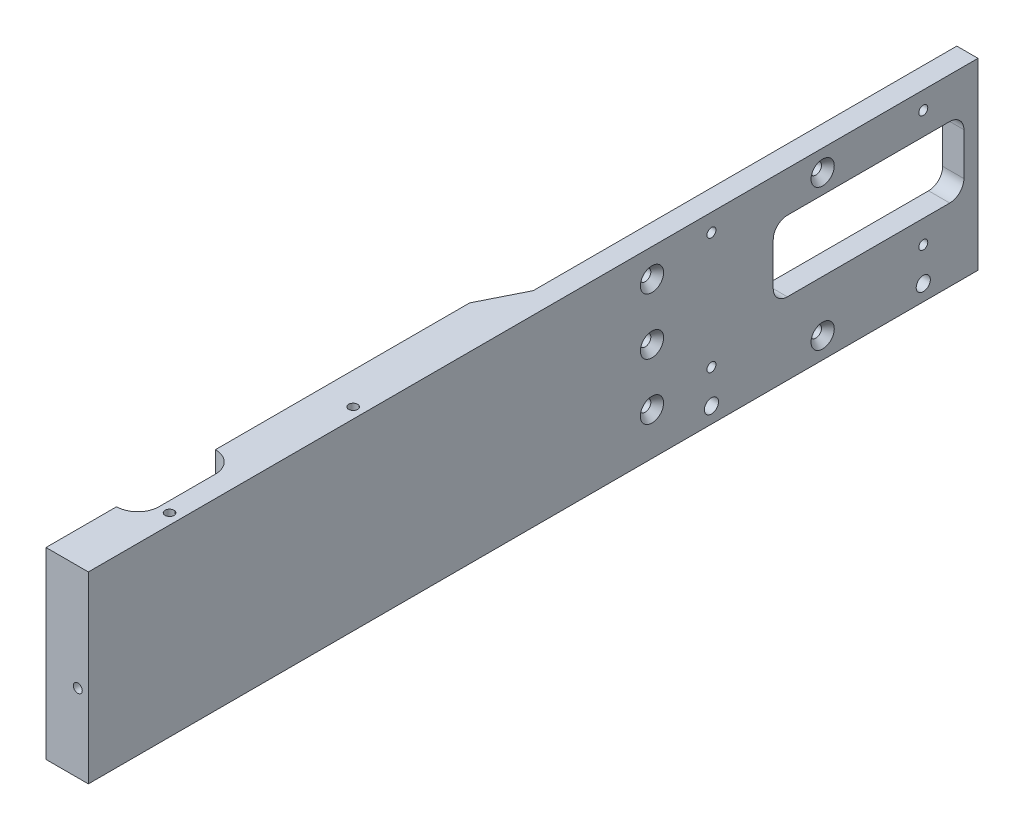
ISO-10303-21;
HEADER;
FILE_DESCRIPTION(('STEP AP214'),'2;1');
FILE_NAME('part.step','',(''),(''),'','','');
FILE_SCHEMA(('AUTOMOTIVE_DESIGN { 1 0 10303 214 1 1 1 1 }'));
ENDSEC;
DATA;
#1=APPLICATION_CONTEXT('core data for automotive mechanical design processes');
#2=APPLICATION_PROTOCOL_DEFINITION('international standard','automotive_design',2000,#1);
#3=PRODUCT_CONTEXT('',#1,'mechanical');
#4=PRODUCT('Part','Part','',(#3));
#5=PRODUCT_RELATED_PRODUCT_CATEGORY('part','',(#4));
#6=PRODUCT_DEFINITION_FORMATION('','',#4);
#7=PRODUCT_DEFINITION_CONTEXT('part definition',#1,'design');
#8=PRODUCT_DEFINITION('design','',#6,#7);
#9=PRODUCT_DEFINITION_SHAPE('','',#8);
#10=(LENGTH_UNIT() NAMED_UNIT(*) SI_UNIT(.MILLI.,.METRE.));
#11=(NAMED_UNIT(*) PLANE_ANGLE_UNIT() SI_UNIT($,.RADIAN.));
#12=(NAMED_UNIT(*) SI_UNIT($,.STERADIAN.) SOLID_ANGLE_UNIT());
#13=UNCERTAINTY_MEASURE_WITH_UNIT(LENGTH_MEASURE(1.E-05),#10,'distance_accuracy_value','');
#14=(GEOMETRIC_REPRESENTATION_CONTEXT(3) GLOBAL_UNCERTAINTY_ASSIGNED_CONTEXT((#13)) GLOBAL_UNIT_ASSIGNED_CONTEXT((#10,
#11,#12)) REPRESENTATION_CONTEXT('',''));
#15=CARTESIAN_POINT('',(0.,0.,0.));
#16=DIRECTION('',(0.,0.,1.));
#17=DIRECTION('',(1.,0.,0.));
#18=AXIS2_PLACEMENT_3D('',#15,#16,#17);
#19=CARTESIAN_POINT('',(82.423,34.1376,-190.5));
#20=DIRECTION('',(0.,1.,0.));
#21=DIRECTION('',(0.,0.,1.));
#22=AXIS2_PLACEMENT_3D('',#19,#20,#21);
#23=PLANE('',#22);
#24=CARTESIAN_POINT('',(87.1855,34.1376,-123.824999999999));
#25=DIRECTION('',(0.,1.,0.));
#26=DIRECTION('',(0.,0.,1.));
#27=AXIS2_PLACEMENT_3D('',#24,#25,#26);
#28=CIRCLE('',#27,2.0193);
#29=CARTESIAN_POINT('',(87.1855,34.1376,-121.805699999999));
#30=VERTEX_POINT('',#29);
#31=EDGE_CURVE('E232',#30,#30,#28,.T.);
#32=ORIENTED_EDGE('',*,*,#31,.F.);
#33=EDGE_LOOP('',(#32));
#34=FACE_BOUND('',#33,.T.);
#35=CARTESIAN_POINT('',(87.1855,34.1376,-41.2749999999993));
#36=DIRECTION('',(0.,1.,0.));
#37=DIRECTION('',(0.,0.,1.));
#38=AXIS2_PLACEMENT_3D('',#35,#36,#37);
#39=CIRCLE('',#38,2.0193);
#40=CARTESIAN_POINT('',(87.1855,34.1376,-39.2556999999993));
#41=VERTEX_POINT('',#40);
#42=EDGE_CURVE('E226',#41,#41,#39,.T.);
#43=ORIENTED_EDGE('',*,*,#42,.F.);
#44=EDGE_LOOP('',(#43));
#45=FACE_BOUND('',#44,.T.);
#46=DIRECTION('',(0.,0.,-1.));
#47=VECTOR('',#46,1.);
#48=CARTESIAN_POINT('',(72.898,34.1376,0.));
#49=LINE('',#48,#47);
#50=CARTESIAN_POINT('',(72.898,34.1376,-76.2));
#51=VERTEX_POINT('',#50);
#52=CARTESIAN_POINT('',(72.898,34.1376,-190.5));
#53=VERTEX_POINT('',#52);
#54=EDGE_CURVE('E205',#51,#53,#49,.T.);
#55=ORIENTED_EDGE('',*,*,#54,.F.);
#56=CARTESIAN_POINT('',(72.898,34.1376,-66.675));
#57=DIRECTION('',(0.,-1.,0.));
#58=DIRECTION('',(0.,0.,-1.));
#59=AXIS2_PLACEMENT_3D('',#56,#57,#58);
#60=CIRCLE('',#59,9.52500000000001);
#61=CARTESIAN_POINT('',(82.423,34.1376,-66.675));
#62=VERTEX_POINT('',#61);
#63=EDGE_CURVE('E187',#51,#62,#60,.T.);
#64=ORIENTED_EDGE('',*,*,#63,.T.);
#65=DIRECTION('',(0.,0.,1.));
#66=VECTOR('',#65,1.);
#67=CARTESIAN_POINT('',(82.423,34.1376,-66.675));
#68=LINE('',#67,#66);
#69=CARTESIAN_POINT('',(82.423,34.1376,-41.275));
#70=VERTEX_POINT('',#69);
#71=EDGE_CURVE('E196',#62,#70,#68,.T.);
#72=ORIENTED_EDGE('',*,*,#71,.T.);
#73=CARTESIAN_POINT('',(72.898,34.1376,-41.275));
#74=DIRECTION('',(0.,-1.,0.));
#75=DIRECTION('',(0.,0.,-1.));
#76=AXIS2_PLACEMENT_3D('',#73,#74,#75);
#77=CIRCLE('',#76,9.52500000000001);
#78=CARTESIAN_POINT('',(72.898,34.1376,-31.75));
#79=VERTEX_POINT('',#78);
#80=EDGE_CURVE('E201',#70,#79,#77,.T.);
#81=ORIENTED_EDGE('',*,*,#80,.T.);
#82=CARTESIAN_POINT('',(72.898,34.1376,0.));
#83=VERTEX_POINT('',#82);
#84=EDGE_CURVE('E285',#83,#79,#49,.T.);
#85=ORIENTED_EDGE('',*,*,#84,.F.);
#86=DIRECTION('',(-1.,0.,0.));
#87=VECTOR('',#86,1.);
#88=CARTESIAN_POINT('',(72.898,34.1376,0.));
#89=LINE('',#88,#87);
#90=CARTESIAN_POINT('',(91.948,34.1376,0.));
#91=VERTEX_POINT('',#90);
#92=EDGE_CURVE('E283',#91,#83,#89,.T.);
#93=ORIENTED_EDGE('',*,*,#92,.F.);
#94=DIRECTION('',(0.,0.,1.));
#95=VECTOR('',#94,1.);
#96=CARTESIAN_POINT('',(91.948,34.1376,-190.5));
#97=LINE('',#96,#95);
#98=CARTESIAN_POINT('',(91.948,34.1376,-400.05));
#99=VERTEX_POINT('',#98);
#100=EDGE_CURVE('E412',#99,#91,#97,.T.);
#101=ORIENTED_EDGE('',*,*,#100,.F.);
#102=DIRECTION('',(1.,0.,0.));
#103=VECTOR('',#102,1.);
#104=CARTESIAN_POINT('',(82.423,34.1376,-400.05));
#105=LINE('',#104,#103);
#106=CARTESIAN_POINT('',(82.423,34.1376,-400.05));
#107=VERTEX_POINT('',#106);
#108=EDGE_CURVE('E320',#107,#99,#105,.T.);
#109=ORIENTED_EDGE('',*,*,#108,.F.);
#110=DIRECTION('',(0.,0.,1.));
#111=VECTOR('',#110,1.);
#112=CARTESIAN_POINT('',(82.423,34.1376,-190.5));
#113=LINE('',#112,#111);
#114=CARTESIAN_POINT('',(82.423,34.1376,-209.55));
#115=VERTEX_POINT('',#114);
#116=EDGE_CURVE('E429',#107,#115,#113,.T.);
#117=ORIENTED_EDGE('',*,*,#116,.T.);
#118=DIRECTION('',(-0.447213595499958,0.,0.894427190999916));
#119=VECTOR('',#118,1.);
#120=CARTESIAN_POINT('',(72.898,34.1376,-190.5));
#121=LINE('',#120,#119);
#122=EDGE_CURVE('E300',#115,#53,#121,.T.);
#123=ORIENTED_EDGE('',*,*,#122,.T.);
#124=EDGE_LOOP('',(#55,#64,#72,#81,#85,#93,#101,#109,#117,#123));
#125=FACE_BOUND('',#124,.T.);
#126=ADVANCED_FACE('F44',(#34,#45,#125),#23,.T.);
#127=CARTESIAN_POINT('',(82.423,-48.4187500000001,-190.5));
#128=DIRECTION('',(0.,-1.,0.));
#129=DIRECTION('',(0.,0.,-1.));
#130=AXIS2_PLACEMENT_3D('',#127,#128,#129);
#131=PLANE('',#130);
#132=DIRECTION('',(0.,0.,-1.));
#133=VECTOR('',#132,1.);
#134=CARTESIAN_POINT('',(82.423,-48.4187500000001,-190.5));
#135=LINE('',#134,#133);
#136=CARTESIAN_POINT('',(82.423,-48.41875,-41.275));
#137=VERTEX_POINT('',#136);
#138=CARTESIAN_POINT('',(82.423,-48.41875,-66.675));
#139=VERTEX_POINT('',#138);
#140=EDGE_CURVE('E11',#137,#139,#135,.T.);
#141=ORIENTED_EDGE('',*,*,#140,.T.);
#142=CARTESIAN_POINT('',(72.898,-48.41875,-66.675));
#143=DIRECTION('',(0.,-1.,0.));
#144=DIRECTION('',(0.,0.,-1.));
#145=AXIS2_PLACEMENT_3D('',#142,#143,#144);
#146=CIRCLE('',#145,9.52500000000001);
#147=CARTESIAN_POINT('',(72.898,-48.4187500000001,-76.2));
#148=VERTEX_POINT('',#147);
#149=EDGE_CURVE('E190',#139,#148,#146,.F.);
#150=ORIENTED_EDGE('',*,*,#149,.T.);
#151=DIRECTION('',(0.,0.,-1.));
#152=VECTOR('',#151,1.);
#153=CARTESIAN_POINT('',(72.898,-48.4187500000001,0.));
#154=LINE('',#153,#152);
#155=CARTESIAN_POINT('',(72.898,-48.4187500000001,-190.5));
#156=VERTEX_POINT('',#155);
#157=EDGE_CURVE('E288',#148,#156,#154,.T.);
#158=ORIENTED_EDGE('',*,*,#157,.T.);
#159=DIRECTION('',(-0.447213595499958,0.,0.894427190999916));
#160=VECTOR('',#159,1.);
#161=CARTESIAN_POINT('',(72.898,-48.4187500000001,-190.5));
#162=LINE('',#161,#160);
#163=CARTESIAN_POINT('',(82.423,-48.4187500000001,-209.55));
#164=VERTEX_POINT('',#163);
#165=EDGE_CURVE('E292',#164,#156,#162,.T.);
#166=ORIENTED_EDGE('',*,*,#165,.F.);
#167=DIRECTION('',(0.,0.,-1.));
#168=VECTOR('',#167,1.);
#169=CARTESIAN_POINT('',(82.423,-48.4187500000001,-190.5));
#170=LINE('',#169,#168);
#171=CARTESIAN_POINT('',(82.423,-48.4187500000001,-400.05));
#172=VERTEX_POINT('',#171);
#173=EDGE_CURVE('E301',#164,#172,#170,.T.);
#174=ORIENTED_EDGE('',*,*,#173,.T.);
#175=DIRECTION('',(1.,0.,0.));
#176=VECTOR('',#175,1.);
#177=CARTESIAN_POINT('',(82.423,-48.4187500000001,-400.05));
#178=LINE('',#177,#176);
#179=CARTESIAN_POINT('',(91.948,-48.4187500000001,-400.05));
#180=VERTEX_POINT('',#179);
#181=EDGE_CURVE('E408',#172,#180,#178,.T.);
#182=ORIENTED_EDGE('',*,*,#181,.T.);
#183=DIRECTION('',(0.,0.,-1.));
#184=VECTOR('',#183,1.);
#185=CARTESIAN_POINT('',(91.948,-48.4187500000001,-190.5));
#186=LINE('',#185,#184);
#187=CARTESIAN_POINT('',(91.948,-48.4187500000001,0.));
#188=VERTEX_POINT('',#187);
#189=EDGE_CURVE('E413',#188,#180,#186,.T.);
#190=ORIENTED_EDGE('',*,*,#189,.F.);
#191=DIRECTION('',(1.,0.,0.));
#192=VECTOR('',#191,1.);
#193=CARTESIAN_POINT('',(72.898,-48.4187500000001,0.));
#194=LINE('',#193,#192);
#195=CARTESIAN_POINT('',(72.898,-48.4187500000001,0.));
#196=VERTEX_POINT('',#195);
#197=EDGE_CURVE('E276',#196,#188,#194,.T.);
#198=ORIENTED_EDGE('',*,*,#197,.F.);
#199=CARTESIAN_POINT('',(72.898,-48.4187500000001,-31.75));
#200=VERTEX_POINT('',#199);
#201=EDGE_CURVE('E289',#196,#200,#154,.T.);
#202=ORIENTED_EDGE('',*,*,#201,.T.);
#203=CARTESIAN_POINT('',(72.898,-48.41875,-41.275));
#204=DIRECTION('',(0.,-1.,0.));
#205=DIRECTION('',(0.,0.,-1.));
#206=AXIS2_PLACEMENT_3D('',#203,#204,#205);
#207=CIRCLE('',#206,9.52500000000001);
#208=EDGE_CURVE('E61',#200,#137,#207,.F.);
#209=ORIENTED_EDGE('',*,*,#208,.T.);
#210=EDGE_LOOP('',(#141,#150,#158,#166,#174,#182,#190,#198,#202,#209));
#211=FACE_BOUND('',#210,.T.);
#212=ADVANCED_FACE('F46',(#211),#131,.T.);
#213=CARTESIAN_POINT('',(72.898,34.1376,0.));
#214=DIRECTION('',(1.,0.,0.));
#215=DIRECTION('',(0.,0.,-1.));
#216=AXIS2_PLACEMENT_3D('',#213,#214,#215);
#217=PLANE('',#216);
#218=DIRECTION('',(0.,1.,0.));
#219=VECTOR('',#218,1.);
#220=CARTESIAN_POINT('',(72.898,-48.4188000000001,-76.2));
#221=LINE('',#220,#219);
#222=EDGE_CURVE('E53',#51,#148,#221,.F.);
#223=ORIENTED_EDGE('',*,*,#222,.F.);
#224=ORIENTED_EDGE('',*,*,#54,.T.);
#225=DIRECTION('',(0.,-1.,0.));
#226=VECTOR('',#225,1.);
#227=CARTESIAN_POINT('',(72.898,55.4361474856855,-190.5));
#228=LINE('',#227,#226);
#229=EDGE_CURVE('E295',#53,#156,#228,.T.);
#230=ORIENTED_EDGE('',*,*,#229,.T.);
#231=ORIENTED_EDGE('',*,*,#157,.F.);
#232=EDGE_LOOP('',(#223,#224,#230,#231));
#233=FACE_BOUND('',#232,.T.);
#234=ADVANCED_FACE('F382',(#233),#217,.F.);
#235=DIRECTION('',(0.,1.,0.));
#236=VECTOR('',#235,1.);
#237=CARTESIAN_POINT('',(72.898,-48.4188000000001,-31.75));
#238=LINE('',#237,#236);
#239=EDGE_CURVE('E317',#200,#79,#238,.T.);
#240=ORIENTED_EDGE('',*,*,#239,.F.);
#241=ORIENTED_EDGE('',*,*,#201,.F.);
#242=DIRECTION('',(0.,-1.,0.));
#243=VECTOR('',#242,1.);
#244=CARTESIAN_POINT('',(72.898,34.1376,0.));
#245=LINE('',#244,#243);
#246=EDGE_CURVE('E270',#83,#196,#245,.T.);
#247=ORIENTED_EDGE('',*,*,#246,.F.);
#248=ORIENTED_EDGE('',*,*,#84,.T.);
#249=EDGE_LOOP('',(#240,#241,#247,#248));
#250=FACE_BOUND('',#249,.T.);
#251=ADVANCED_FACE('F538',(#250),#217,.F.);
#252=CARTESIAN_POINT('',(82.423,-48.4187500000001,-190.5));
#253=DIRECTION('',(1.,0.,0.));
#254=DIRECTION('',(0.,0.,-1.));
#255=AXIS2_PLACEMENT_3D('',#252,#253,#254);
#256=PLANE('',#255);
#257=CARTESIAN_POINT('',(82.423,21.4376,-253.4412));
#258=DIRECTION('',(1.,0.,0.));
#259=DIRECTION('',(0.,0.,-1.));
#260=AXIS2_PLACEMENT_3D('',#257,#258,#259);
#261=CIRCLE('',#260,2.5527);
#262=CARTESIAN_POINT('',(82.423,21.4376,-255.9939));
#263=VERTEX_POINT('',#262);
#264=EDGE_CURVE('E48',#263,#263,#261,.T.);
#265=ORIENTED_EDGE('',*,*,#264,.T.);
#266=EDGE_LOOP('',(#265));
#267=FACE_BOUND('',#266,.T.);
#268=CARTESIAN_POINT('',(82.423,-3.9624,-253.4412));
#269=DIRECTION('',(1.,0.,0.));
#270=DIRECTION('',(0.,0.,-1.));
#271=AXIS2_PLACEMENT_3D('',#268,#269,#270);
#272=CIRCLE('',#271,2.5527);
#273=CARTESIAN_POINT('',(82.423,-3.9624,-255.9939));
#274=VERTEX_POINT('',#273);
#275=EDGE_CURVE('E332',#274,#274,#272,.T.);
#276=ORIENTED_EDGE('',*,*,#275,.T.);
#277=EDGE_LOOP('',(#276));
#278=FACE_BOUND('',#277,.T.);
#279=CARTESIAN_POINT('',(82.423,-38.8937500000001,-330.2));
#280=DIRECTION('',(1.,0.,0.));
#281=DIRECTION('',(0.,0.,-1.));
#282=AXIS2_PLACEMENT_3D('',#279,#280,#281);
#283=CIRCLE('',#282,2.5527);
#284=CARTESIAN_POINT('',(82.423,-38.8937500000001,-332.7527));
#285=VERTEX_POINT('',#284);
#286=EDGE_CURVE('E328',#285,#285,#283,.T.);
#287=ORIENTED_EDGE('',*,*,#286,.T.);
#288=EDGE_LOOP('',(#287));
#289=FACE_BOUND('',#288,.T.);
#290=CARTESIAN_POINT('',(82.423,24.6126,-330.2));
#291=DIRECTION('',(1.,0.,0.));
#292=DIRECTION('',(0.,0.,-1.));
#293=AXIS2_PLACEMENT_3D('',#290,#291,#292);
#294=CIRCLE('',#293,2.5527);
#295=CARTESIAN_POINT('',(82.423,24.6126,-332.7527));
#296=VERTEX_POINT('',#295);
#297=EDGE_CURVE('E323',#296,#296,#294,.T.);
#298=ORIENTED_EDGE('',*,*,#297,.T.);
#299=EDGE_LOOP('',(#298));
#300=FACE_BOUND('',#299,.T.);
#301=CARTESIAN_POINT('',(82.423,-29.3624,-253.4412));
#302=DIRECTION('',(1.,0.,0.));
#303=DIRECTION('',(0.,0.,-1.));
#304=AXIS2_PLACEMENT_3D('',#301,#302,#303);
#305=CIRCLE('',#304,2.5527);
#306=CARTESIAN_POINT('',(82.423,-29.3624,-255.9939));
#307=VERTEX_POINT('',#306);
#308=EDGE_CURVE('E206',#307,#307,#305,.T.);
#309=ORIENTED_EDGE('',*,*,#308,.T.);
#310=EDGE_LOOP('',(#309));
#311=FACE_BOUND('',#310,.T.);
#312=CARTESIAN_POINT('',(82.423,-41.275,-280.19375));
#313=DIRECTION('',(1.,0.,0.));
#314=DIRECTION('',(0.,0.,-1.));
#315=AXIS2_PLACEMENT_3D('',#312,#313,#314);
#316=CIRCLE('',#315,3.17499999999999);
#317=CARTESIAN_POINT('',(82.423,-41.275,-283.36875));
#318=VERTEX_POINT('',#317);
#319=EDGE_CURVE('E242',#318,#318,#316,.T.);
#320=ORIENTED_EDGE('',*,*,#319,.T.);
#321=EDGE_LOOP('',(#320));
#322=FACE_BOUND('',#321,.T.);
#323=CARTESIAN_POINT('',(82.423,-41.275,-375.44375));
#324=DIRECTION('',(1.,0.,0.));
#325=DIRECTION('',(0.,0.,-1.));
#326=AXIS2_PLACEMENT_3D('',#323,#324,#325);
#327=CIRCLE('',#326,3.17499999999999);
#328=CARTESIAN_POINT('',(82.423,-41.275,-378.61875));
#329=VERTEX_POINT('',#328);
#330=EDGE_CURVE('E246',#329,#329,#327,.T.);
#331=ORIENTED_EDGE('',*,*,#330,.T.);
#332=EDGE_LOOP('',(#331));
#333=FACE_BOUND('',#332,.T.);
#334=CARTESIAN_POINT('',(82.423,-26.1874,-280.19375));
#335=DIRECTION('',(-1.,0.,0.));
#336=DIRECTION('',(0.,0.,1.));
#337=AXIS2_PLACEMENT_3D('',#334,#335,#336);
#338=CIRCLE('',#337,2.01929999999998);
#339=CARTESIAN_POINT('',(82.423,-26.1874,-278.17445));
#340=VERTEX_POINT('',#339);
#341=EDGE_CURVE('E251',#340,#340,#338,.T.);
#342=ORIENTED_EDGE('',*,*,#341,.F.);
#343=EDGE_LOOP('',(#342));
#344=FACE_BOUND('',#343,.T.);
#345=CARTESIAN_POINT('',(82.423,26.2001,-280.19375));
#346=DIRECTION('',(-1.,0.,0.));
#347=DIRECTION('',(0.,0.,1.));
#348=AXIS2_PLACEMENT_3D('',#345,#346,#347);
#349=CIRCLE('',#348,2.01929999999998);
#350=CARTESIAN_POINT('',(82.423,26.2001,-278.17445));
#351=VERTEX_POINT('',#350);
#352=EDGE_CURVE('E250',#351,#351,#349,.T.);
#353=ORIENTED_EDGE('',*,*,#352,.F.);
#354=EDGE_LOOP('',(#353));
#355=FACE_BOUND('',#354,.T.);
#356=CARTESIAN_POINT('',(82.423,-26.1874,-375.44375));
#357=DIRECTION('',(-1.,0.,0.));
#358=DIRECTION('',(0.,0.,1.));
#359=AXIS2_PLACEMENT_3D('',#356,#357,#358);
#360=CIRCLE('',#359,2.01929999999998);
#361=CARTESIAN_POINT('',(82.423,-26.1874,-373.42445));
#362=VERTEX_POINT('',#361);
#363=EDGE_CURVE('E257',#362,#362,#360,.T.);
#364=ORIENTED_EDGE('',*,*,#363,.F.);
#365=EDGE_LOOP('',(#364));
#366=FACE_BOUND('',#365,.T.);
#367=CARTESIAN_POINT('',(82.423,26.2001,-375.44375));
#368=DIRECTION('',(-1.,0.,0.));
#369=DIRECTION('',(0.,0.,1.));
#370=AXIS2_PLACEMENT_3D('',#367,#368,#369);
#371=CIRCLE('',#370,2.01929999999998);
#372=CARTESIAN_POINT('',(82.423,26.2001,-373.42445));
#373=VERTEX_POINT('',#372);
#374=EDGE_CURVE('E263',#373,#373,#371,.T.);
#375=ORIENTED_EDGE('',*,*,#374,.F.);
#376=EDGE_LOOP('',(#375));
#377=FACE_BOUND('',#376,.T.);
#378=CARTESIAN_POINT('',(82.423,-9.52500000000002,-314.325));
#379=DIRECTION('',(1.,0.,0.));
#380=DIRECTION('',(0.,0.,-1.));
#381=AXIS2_PLACEMENT_3D('',#378,#379,#380);
#382=CIRCLE('',#381,6.35);
#383=CARTESIAN_POINT('',(82.423,-9.52500000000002,-307.975));
#384=VERTEX_POINT('',#383);
#385=CARTESIAN_POINT('',(82.423,-15.875,-314.325));
#386=VERTEX_POINT('',#385);
#387=EDGE_CURVE('E310',#384,#386,#382,.T.);
#388=ORIENTED_EDGE('',*,*,#387,.T.);
#389=DIRECTION('',(0.,0.,-1.));
#390=VECTOR('',#389,1.);
#391=CARTESIAN_POINT('',(82.423,-15.875,-314.325));
#392=LINE('',#391,#390);
#393=CARTESIAN_POINT('',(82.423,-15.875,-387.35));
#394=VERTEX_POINT('',#393);
#395=EDGE_CURVE('E471',#386,#394,#392,.T.);
#396=ORIENTED_EDGE('',*,*,#395,.T.);
#397=CARTESIAN_POINT('',(82.423,-9.52500000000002,-387.35));
#398=DIRECTION('',(-1.,0.,0.));
#399=DIRECTION('',(0.,0.,1.));
#400=AXIS2_PLACEMENT_3D('',#397,#398,#399);
#401=CIRCLE('',#400,6.35000000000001);
#402=CARTESIAN_POINT('',(82.423,-9.52499999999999,-393.7));
#403=VERTEX_POINT('',#402);
#404=EDGE_CURVE('E468',#403,#394,#401,.T.);
#405=ORIENTED_EDGE('',*,*,#404,.F.);
#406=DIRECTION('',(0.,-1.,0.));
#407=VECTOR('',#406,1.);
#408=CARTESIAN_POINT('',(82.423,9.52500000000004,-393.7));
#409=LINE('',#408,#407);
#410=CARTESIAN_POINT('',(82.423,9.52500000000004,-393.7));
#411=VERTEX_POINT('',#410);
#412=EDGE_CURVE('E465',#411,#403,#409,.T.);
#413=ORIENTED_EDGE('',*,*,#412,.F.);
#414=CARTESIAN_POINT('',(82.423,9.52500000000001,-387.35));
#415=DIRECTION('',(-1.,0.,0.));
#416=DIRECTION('',(0.,0.,1.));
#417=AXIS2_PLACEMENT_3D('',#414,#415,#416);
#418=CIRCLE('',#417,6.35000000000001);
#419=CARTESIAN_POINT('',(82.423,15.875,-387.35));
#420=VERTEX_POINT('',#419);
#421=EDGE_CURVE('E462',#420,#411,#418,.T.);
#422=ORIENTED_EDGE('',*,*,#421,.F.);
#423=DIRECTION('',(0.,0.,1.));
#424=VECTOR('',#423,1.);
#425=CARTESIAN_POINT('',(82.423,15.875,-387.35));
#426=LINE('',#425,#424);
#427=CARTESIAN_POINT('',(82.423,15.875,-314.325));
#428=VERTEX_POINT('',#427);
#429=EDGE_CURVE('E458',#420,#428,#426,.T.);
#430=ORIENTED_EDGE('',*,*,#429,.T.);
#431=CARTESIAN_POINT('',(82.423,9.52500000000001,-314.325));
#432=DIRECTION('',(1.,0.,0.));
#433=DIRECTION('',(0.,0.,-1.));
#434=AXIS2_PLACEMENT_3D('',#431,#432,#433);
#435=CIRCLE('',#434,6.35000000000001);
#436=CARTESIAN_POINT('',(82.423,9.52500000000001,-307.975));
#437=VERTEX_POINT('',#436);
#438=EDGE_CURVE('E455',#428,#437,#435,.T.);
#439=ORIENTED_EDGE('',*,*,#438,.T.);
#440=DIRECTION('',(0.,-1.,0.));
#441=VECTOR('',#440,1.);
#442=CARTESIAN_POINT('',(82.423,9.52500000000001,-307.975));
#443=LINE('',#442,#441);
#444=EDGE_CURVE('E451',#437,#384,#443,.T.);
#445=ORIENTED_EDGE('',*,*,#444,.T.);
#446=EDGE_LOOP('',(#388,#396,#405,#413,#422,#430,#439,#445));
#447=FACE_BOUND('',#446,.T.);
#448=DIRECTION('',(0.,-1.,0.));
#449=VECTOR('',#448,1.);
#450=CARTESIAN_POINT('',(82.423,55.4361474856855,-209.55));
#451=LINE('',#450,#449);
#452=EDGE_CURVE('E69',#115,#164,#451,.T.);
#453=ORIENTED_EDGE('',*,*,#452,.F.);
#454=ORIENTED_EDGE('',*,*,#116,.F.);
#455=DIRECTION('',(0.,1.,0.));
#456=VECTOR('',#455,1.);
#457=CARTESIAN_POINT('',(82.423,34.1376,-400.05));
#458=LINE('',#457,#456);
#459=EDGE_CURVE('E431',#172,#107,#458,.T.);
#460=ORIENTED_EDGE('',*,*,#459,.F.);
#461=ORIENTED_EDGE('',*,*,#173,.F.);
#462=EDGE_LOOP('',(#453,#454,#460,#461));
#463=FACE_BOUND('',#462,.T.);
#464=ADVANCED_FACE('F400',(#267,#278,#289,#300,#311,#322,#333,#344,#355,#366,#377,#447,#463),
#256,.F.);
#465=CARTESIAN_POINT('',(91.948,-48.4187500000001,-190.5));
#466=DIRECTION('',(1.,0.,0.));
#467=DIRECTION('',(0.,0.,-1.));
#468=AXIS2_PLACEMENT_3D('',#465,#466,#467);
#469=PLANE('',#468);
#470=CARTESIAN_POINT('',(91.948,21.4376,-253.4412));
#471=DIRECTION('',(1.,0.,0.));
#472=DIRECTION('',(0.,0.,-1.));
#473=AXIS2_PLACEMENT_3D('',#470,#471,#472);
#474=CIRCLE('',#473,5.2197);
#475=CARTESIAN_POINT('',(91.948,21.4376,-258.6609));
#476=VERTEX_POINT('',#475);
#477=EDGE_CURVE('E802',#476,#476,#474,.T.);
#478=ORIENTED_EDGE('',*,*,#477,.F.);
#479=EDGE_LOOP('',(#478));
#480=FACE_BOUND('',#479,.T.);
#481=CARTESIAN_POINT('',(91.948,-3.9624,-253.4412));
#482=DIRECTION('',(1.,0.,0.));
#483=DIRECTION('',(0.,0.,-1.));
#484=AXIS2_PLACEMENT_3D('',#481,#482,#483);
#485=CIRCLE('',#484,5.2197);
#486=CARTESIAN_POINT('',(91.948,-3.9624,-258.6609));
#487=VERTEX_POINT('',#486);
#488=EDGE_CURVE('E341',#487,#487,#485,.T.);
#489=ORIENTED_EDGE('',*,*,#488,.F.);
#490=EDGE_LOOP('',(#489));
#491=FACE_BOUND('',#490,.T.);
#492=CARTESIAN_POINT('',(91.948,-38.8937500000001,-330.2));
#493=DIRECTION('',(1.,0.,0.));
#494=DIRECTION('',(0.,0.,-1.));
#495=AXIS2_PLACEMENT_3D('',#492,#493,#494);
#496=CIRCLE('',#495,5.2197);
#497=CARTESIAN_POINT('',(91.948,-38.8937500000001,-335.4197));
#498=VERTEX_POINT('',#497);
#499=EDGE_CURVE('E334',#498,#498,#496,.T.);
#500=ORIENTED_EDGE('',*,*,#499,.F.);
#501=EDGE_LOOP('',(#500));
#502=FACE_BOUND('',#501,.T.);
#503=CARTESIAN_POINT('',(91.948,24.6126,-330.2));
#504=DIRECTION('',(1.,0.,0.));
#505=DIRECTION('',(0.,0.,-1.));
#506=AXIS2_PLACEMENT_3D('',#503,#504,#505);
#507=CIRCLE('',#506,5.2197);
#508=CARTESIAN_POINT('',(91.948,24.6126,-335.4197));
#509=VERTEX_POINT('',#508);
#510=EDGE_CURVE('E330',#509,#509,#507,.T.);
#511=ORIENTED_EDGE('',*,*,#510,.F.);
#512=EDGE_LOOP('',(#511));
#513=FACE_BOUND('',#512,.T.);
#514=CARTESIAN_POINT('',(91.948,-29.3624,-253.4412));
#515=DIRECTION('',(1.,0.,0.));
#516=DIRECTION('',(0.,0.,-1.));
#517=AXIS2_PLACEMENT_3D('',#514,#515,#516);
#518=CIRCLE('',#517,5.2197);
#519=CARTESIAN_POINT('',(91.948,-29.3624,-258.6609));
#520=VERTEX_POINT('',#519);
#521=EDGE_CURVE('E326',#520,#520,#518,.T.);
#522=ORIENTED_EDGE('',*,*,#521,.F.);
#523=EDGE_LOOP('',(#522));
#524=FACE_BOUND('',#523,.T.);
#525=CARTESIAN_POINT('',(91.948,-41.275,-280.19375));
#526=DIRECTION('',(1.,0.,0.));
#527=DIRECTION('',(0.,0.,-1.));
#528=AXIS2_PLACEMENT_3D('',#525,#526,#527);
#529=CIRCLE('',#528,3.17499999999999);
#530=CARTESIAN_POINT('',(91.948,-41.275,-283.36875));
#531=VERTEX_POINT('',#530);
#532=EDGE_CURVE('E239',#531,#531,#529,.T.);
#533=ORIENTED_EDGE('',*,*,#532,.F.);
#534=EDGE_LOOP('',(#533));
#535=FACE_BOUND('',#534,.T.);
#536=CARTESIAN_POINT('',(91.948,-41.275,-375.44375));
#537=DIRECTION('',(1.,0.,0.));
#538=DIRECTION('',(0.,0.,-1.));
#539=AXIS2_PLACEMENT_3D('',#536,#537,#538);
#540=CIRCLE('',#539,3.17499999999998);
#541=CARTESIAN_POINT('',(91.948,-41.275,-378.61875));
#542=VERTEX_POINT('',#541);
#543=EDGE_CURVE('E243',#542,#542,#540,.T.);
#544=ORIENTED_EDGE('',*,*,#543,.F.);
#545=EDGE_LOOP('',(#544));
#546=FACE_BOUND('',#545,.T.);
#547=CARTESIAN_POINT('',(91.948,-26.1874,-280.19375));
#548=DIRECTION('',(-1.,0.,0.));
#549=DIRECTION('',(0.,0.,1.));
#550=AXIS2_PLACEMENT_3D('',#547,#548,#549);
#551=CIRCLE('',#550,2.01929999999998);
#552=CARTESIAN_POINT('',(91.948,-26.1874,-278.17445));
#553=VERTEX_POINT('',#552);
#554=EDGE_CURVE('E247',#553,#553,#551,.T.);
#555=ORIENTED_EDGE('',*,*,#554,.T.);
#556=EDGE_LOOP('',(#555));
#557=FACE_BOUND('',#556,.T.);
#558=CARTESIAN_POINT('',(91.948,26.2001,-280.19375));
#559=DIRECTION('',(-1.,0.,0.));
#560=DIRECTION('',(0.,0.,1.));
#561=AXIS2_PLACEMENT_3D('',#558,#559,#560);
#562=CIRCLE('',#561,2.01929999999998);
#563=CARTESIAN_POINT('',(91.948,26.2001,-278.17445));
#564=VERTEX_POINT('',#563);
#565=EDGE_CURVE('E254',#564,#564,#562,.T.);
#566=ORIENTED_EDGE('',*,*,#565,.T.);
#567=EDGE_LOOP('',(#566));
#568=FACE_BOUND('',#567,.T.);
#569=CARTESIAN_POINT('',(91.948,-26.1874,-375.44375));
#570=DIRECTION('',(-1.,0.,0.));
#571=DIRECTION('',(0.,0.,1.));
#572=AXIS2_PLACEMENT_3D('',#569,#570,#571);
#573=CIRCLE('',#572,2.01929999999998);
#574=CARTESIAN_POINT('',(91.948,-26.1874,-373.42445));
#575=VERTEX_POINT('',#574);
#576=EDGE_CURVE('E260',#575,#575,#573,.T.);
#577=ORIENTED_EDGE('',*,*,#576,.T.);
#578=EDGE_LOOP('',(#577));
#579=FACE_BOUND('',#578,.T.);
#580=CARTESIAN_POINT('',(91.948,26.2001,-375.44375));
#581=DIRECTION('',(-1.,0.,0.));
#582=DIRECTION('',(0.,0.,1.));
#583=AXIS2_PLACEMENT_3D('',#580,#581,#582);
#584=CIRCLE('',#583,2.01929999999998);
#585=CARTESIAN_POINT('',(91.948,26.2001,-373.42445));
#586=VERTEX_POINT('',#585);
#587=EDGE_CURVE('E266',#586,#586,#584,.T.);
#588=ORIENTED_EDGE('',*,*,#587,.T.);
#589=EDGE_LOOP('',(#588));
#590=FACE_BOUND('',#589,.T.);
#591=ORIENTED_EDGE('',*,*,#100,.T.);
#592=DIRECTION('',(0.,1.,0.));
#593=VECTOR('',#592,1.);
#594=CARTESIAN_POINT('',(91.948,34.1376,0.));
#595=LINE('',#594,#593);
#596=EDGE_CURVE('E279',#188,#91,#595,.T.);
#597=ORIENTED_EDGE('',*,*,#596,.F.);
#598=ORIENTED_EDGE('',*,*,#189,.T.);
#599=DIRECTION('',(0.,1.,0.));
#600=VECTOR('',#599,1.);
#601=CARTESIAN_POINT('',(91.948,34.1376,-400.05));
#602=LINE('',#601,#600);
#603=EDGE_CURVE('E405',#180,#99,#602,.T.);
#604=ORIENTED_EDGE('',*,*,#603,.T.);
#605=EDGE_LOOP('',(#591,#597,#598,#604));
#606=FACE_BOUND('',#605,.T.);
#607=DIRECTION('',(0.,0.,-1.));
#608=VECTOR('',#607,1.);
#609=CARTESIAN_POINT('',(91.948,-15.875,-314.325));
#610=LINE('',#609,#608);
#611=CARTESIAN_POINT('',(91.948,-15.875,-314.325));
#612=VERTEX_POINT('',#611);
#613=CARTESIAN_POINT('',(91.948,-15.875,-387.35));
#614=VERTEX_POINT('',#613);
#615=EDGE_CURVE('E493',#612,#614,#610,.T.);
#616=ORIENTED_EDGE('',*,*,#615,.F.);
#617=CARTESIAN_POINT('',(91.948,-9.52500000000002,-314.325));
#618=DIRECTION('',(1.,0.,0.));
#619=DIRECTION('',(0.,0.,-1.));
#620=AXIS2_PLACEMENT_3D('',#617,#618,#619);
#621=CIRCLE('',#620,6.35);
#622=CARTESIAN_POINT('',(91.948,-9.52500000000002,-307.975));
#623=VERTEX_POINT('',#622);
#624=EDGE_CURVE('E454',#623,#612,#621,.T.);
#625=ORIENTED_EDGE('',*,*,#624,.F.);
#626=DIRECTION('',(0.,-1.,0.));
#627=VECTOR('',#626,1.);
#628=CARTESIAN_POINT('',(91.948,9.52500000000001,-307.975));
#629=LINE('',#628,#627);
#630=CARTESIAN_POINT('',(91.948,9.52500000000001,-307.975));
#631=VERTEX_POINT('',#630);
#632=EDGE_CURVE('E450',#631,#623,#629,.T.);
#633=ORIENTED_EDGE('',*,*,#632,.F.);
#634=CARTESIAN_POINT('',(91.948,9.52500000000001,-314.325));
#635=DIRECTION('',(1.,0.,0.));
#636=DIRECTION('',(0.,0.,-1.));
#637=AXIS2_PLACEMENT_3D('',#634,#635,#636);
#638=CIRCLE('',#637,6.35000000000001);
#639=CARTESIAN_POINT('',(91.948,15.875,-314.325));
#640=VERTEX_POINT('',#639);
#641=EDGE_CURVE('E477',#640,#631,#638,.T.);
#642=ORIENTED_EDGE('',*,*,#641,.F.);
#643=DIRECTION('',(0.,0.,1.));
#644=VECTOR('',#643,1.);
#645=CARTESIAN_POINT('',(91.948,15.875,-387.35));
#646=LINE('',#645,#644);
#647=CARTESIAN_POINT('',(91.948,15.875,-387.35));
#648=VERTEX_POINT('',#647);
#649=EDGE_CURVE('E480',#648,#640,#646,.T.);
#650=ORIENTED_EDGE('',*,*,#649,.F.);
#651=CARTESIAN_POINT('',(91.948,9.52500000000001,-387.35));
#652=DIRECTION('',(-1.,0.,0.));
#653=DIRECTION('',(0.,0.,1.));
#654=AXIS2_PLACEMENT_3D('',#651,#652,#653);
#655=CIRCLE('',#654,6.35000000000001);
#656=CARTESIAN_POINT('',(91.948,9.52500000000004,-393.7));
#657=VERTEX_POINT('',#656);
#658=EDGE_CURVE('E483',#648,#657,#655,.T.);
#659=ORIENTED_EDGE('',*,*,#658,.T.);
#660=DIRECTION('',(0.,-1.,0.));
#661=VECTOR('',#660,1.);
#662=CARTESIAN_POINT('',(91.948,9.52500000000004,-393.7));
#663=LINE('',#662,#661);
#664=CARTESIAN_POINT('',(91.948,-9.52499999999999,-393.7));
#665=VERTEX_POINT('',#664);
#666=EDGE_CURVE('E487',#657,#665,#663,.T.);
#667=ORIENTED_EDGE('',*,*,#666,.T.);
#668=CARTESIAN_POINT('',(91.948,-9.52500000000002,-387.35));
#669=DIRECTION('',(-1.,0.,0.));
#670=DIRECTION('',(0.,0.,1.));
#671=AXIS2_PLACEMENT_3D('',#668,#669,#670);
#672=CIRCLE('',#671,6.35000000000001);
#673=EDGE_CURVE('E490',#665,#614,#672,.T.);
#674=ORIENTED_EDGE('',*,*,#673,.T.);
#675=EDGE_LOOP('',(#616,#625,#633,#642,#650,#659,#667,#674));
#676=FACE_BOUND('',#675,.T.);
#677=ADVANCED_FACE('F387',(#480,#491,#502,#513,#524,#535,#546,#557,#568,#579,#590,#606,#676),
#469,.T.);
#678=CARTESIAN_POINT('',(82.423,34.1376,-400.05));
#679=DIRECTION('',(0.,0.,-1.));
#680=DIRECTION('',(-1.,0.,0.));
#681=AXIS2_PLACEMENT_3D('',#678,#679,#680);
#682=PLANE('',#681);
#683=ORIENTED_EDGE('',*,*,#603,.F.);
#684=ORIENTED_EDGE('',*,*,#181,.F.);
#685=ORIENTED_EDGE('',*,*,#459,.T.);
#686=ORIENTED_EDGE('',*,*,#108,.T.);
#687=EDGE_LOOP('',(#683,#684,#685,#686));
#688=FACE_BOUND('',#687,.T.);
#689=ADVANCED_FACE('F389',(#688),#682,.T.);
#690=CARTESIAN_POINT('',(91.948,-9.52500000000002,-314.325));
#691=DIRECTION('',(-1.,0.,0.));
#692=DIRECTION('',(0.,0.,1.));
#693=AXIS2_PLACEMENT_3D('',#690,#691,#692);
#694=CYLINDRICAL_SURFACE('',#693,6.35);
#695=ORIENTED_EDGE('',*,*,#387,.F.);
#696=DIRECTION('',(-1.,0.,0.));
#697=VECTOR('',#696,1.);
#698=CARTESIAN_POINT('',(91.948,-9.52500000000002,-307.975));
#699=LINE('',#698,#697);
#700=EDGE_CURVE('E447',#623,#384,#699,.T.);
#701=ORIENTED_EDGE('',*,*,#700,.F.);
#702=ORIENTED_EDGE('',*,*,#624,.T.);
#703=DIRECTION('',(-1.,0.,0.));
#704=VECTOR('',#703,1.);
#705=CARTESIAN_POINT('',(91.948,-15.875,-314.325));
#706=LINE('',#705,#704);
#707=EDGE_CURVE('E417',#612,#386,#706,.T.);
#708=ORIENTED_EDGE('',*,*,#707,.T.);
#709=EDGE_LOOP('',(#695,#701,#702,#708));
#710=FACE_BOUND('',#709,.T.);
#711=ADVANCED_FACE('F391',(#710),#694,.F.);
#712=CARTESIAN_POINT('',(91.948,-15.875,-314.325));
#713=DIRECTION('',(0.,1.,0.));
#714=DIRECTION('',(0.,0.,1.));
#715=AXIS2_PLACEMENT_3D('',#712,#713,#714);
#716=PLANE('',#715);
#717=ORIENTED_EDGE('',*,*,#395,.F.);
#718=ORIENTED_EDGE('',*,*,#707,.F.);
#719=ORIENTED_EDGE('',*,*,#615,.T.);
#720=DIRECTION('',(-1.,0.,0.));
#721=VECTOR('',#720,1.);
#722=CARTESIAN_POINT('',(91.948,-15.875,-387.35));
#723=LINE('',#722,#721);
#724=EDGE_CURVE('E420',#614,#394,#723,.T.);
#725=ORIENTED_EDGE('',*,*,#724,.T.);
#726=EDGE_LOOP('',(#717,#718,#719,#725));
#727=FACE_BOUND('',#726,.T.);
#728=ADVANCED_FACE('F397',(#727),#716,.T.);
#729=CARTESIAN_POINT('',(91.948,-9.52500000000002,-387.35));
#730=DIRECTION('',(-1.,0.,0.));
#731=DIRECTION('',(0.,0.,1.));
#732=AXIS2_PLACEMENT_3D('',#729,#730,#731);
#733=CYLINDRICAL_SURFACE('',#732,6.35000000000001);
#734=ORIENTED_EDGE('',*,*,#404,.T.);
#735=ORIENTED_EDGE('',*,*,#724,.F.);
#736=ORIENTED_EDGE('',*,*,#673,.F.);
#737=DIRECTION('',(-1.,0.,0.));
#738=VECTOR('',#737,1.);
#739=CARTESIAN_POINT('',(91.948,-9.52499999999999,-393.7));
#740=LINE('',#739,#738);
#741=EDGE_CURVE('E436',#665,#403,#740,.T.);
#742=ORIENTED_EDGE('',*,*,#741,.T.);
#743=EDGE_LOOP('',(#734,#735,#736,#742));
#744=FACE_BOUND('',#743,.T.);
#745=ADVANCED_FACE('F504',(#744),#733,.F.);
#746=CARTESIAN_POINT('',(91.948,9.52500000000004,-393.7));
#747=DIRECTION('',(0.,0.,-1.));
#748=DIRECTION('',(0.,1.,0.));
#749=AXIS2_PLACEMENT_3D('',#746,#747,#748);
#750=PLANE('',#749);
#751=ORIENTED_EDGE('',*,*,#412,.T.);
#752=ORIENTED_EDGE('',*,*,#741,.F.);
#753=ORIENTED_EDGE('',*,*,#666,.F.);
#754=DIRECTION('',(-1.,0.,0.));
#755=VECTOR('',#754,1.);
#756=CARTESIAN_POINT('',(91.948,9.52500000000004,-393.7));
#757=LINE('',#756,#755);
#758=EDGE_CURVE('E438',#657,#411,#757,.T.);
#759=ORIENTED_EDGE('',*,*,#758,.T.);
#760=EDGE_LOOP('',(#751,#752,#753,#759));
#761=FACE_BOUND('',#760,.T.);
#762=ADVANCED_FACE('F525',(#761),#750,.F.);
#763=CARTESIAN_POINT('',(91.948,9.52500000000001,-387.35));
#764=DIRECTION('',(-1.,0.,0.));
#765=DIRECTION('',(0.,0.,1.));
#766=AXIS2_PLACEMENT_3D('',#763,#764,#765);
#767=CYLINDRICAL_SURFACE('',#766,6.35000000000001);
#768=ORIENTED_EDGE('',*,*,#421,.T.);
#769=ORIENTED_EDGE('',*,*,#758,.F.);
#770=ORIENTED_EDGE('',*,*,#658,.F.);
#771=DIRECTION('',(-1.,0.,0.));
#772=VECTOR('',#771,1.);
#773=CARTESIAN_POINT('',(91.948,15.875,-387.35));
#774=LINE('',#773,#772);
#775=EDGE_CURVE('E440',#648,#420,#774,.T.);
#776=ORIENTED_EDGE('',*,*,#775,.T.);
#777=EDGE_LOOP('',(#768,#769,#770,#776));
#778=FACE_BOUND('',#777,.T.);
#779=ADVANCED_FACE('F523',(#778),#767,.F.);
#780=CARTESIAN_POINT('',(91.948,15.875,-387.35));
#781=DIRECTION('',(0.,-1.,0.));
#782=DIRECTION('',(0.,0.,-1.));
#783=AXIS2_PLACEMENT_3D('',#780,#781,#782);
#784=PLANE('',#783);
#785=ORIENTED_EDGE('',*,*,#429,.F.);
#786=ORIENTED_EDGE('',*,*,#775,.F.);
#787=ORIENTED_EDGE('',*,*,#649,.T.);
#788=DIRECTION('',(-1.,0.,0.));
#789=VECTOR('',#788,1.);
#790=CARTESIAN_POINT('',(91.948,15.875,-314.325));
#791=LINE('',#790,#789);
#792=EDGE_CURVE('E443',#640,#428,#791,.T.);
#793=ORIENTED_EDGE('',*,*,#792,.T.);
#794=EDGE_LOOP('',(#785,#786,#787,#793));
#795=FACE_BOUND('',#794,.T.);
#796=ADVANCED_FACE('F519',(#795),#784,.T.);
#797=CARTESIAN_POINT('',(91.948,9.52500000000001,-314.325));
#798=DIRECTION('',(-1.,0.,0.));
#799=DIRECTION('',(0.,0.,1.));
#800=AXIS2_PLACEMENT_3D('',#797,#798,#799);
#801=CYLINDRICAL_SURFACE('',#800,6.35000000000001);
#802=ORIENTED_EDGE('',*,*,#438,.F.);
#803=ORIENTED_EDGE('',*,*,#792,.F.);
#804=ORIENTED_EDGE('',*,*,#641,.T.);
#805=DIRECTION('',(-1.,0.,0.));
#806=VECTOR('',#805,1.);
#807=CARTESIAN_POINT('',(91.948,9.52500000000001,-307.975));
#808=LINE('',#807,#806);
#809=EDGE_CURVE('E445',#631,#437,#808,.T.);
#810=ORIENTED_EDGE('',*,*,#809,.T.);
#811=EDGE_LOOP('',(#802,#803,#804,#810));
#812=FACE_BOUND('',#811,.T.);
#813=ADVANCED_FACE('F516',(#812),#801,.F.);
#814=CARTESIAN_POINT('',(91.948,9.52500000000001,-307.975));
#815=DIRECTION('',(0.,0.,-1.));
#816=DIRECTION('',(-1.,0.,0.));
#817=AXIS2_PLACEMENT_3D('',#814,#815,#816);
#818=PLANE('',#817);
#819=ORIENTED_EDGE('',*,*,#444,.F.);
#820=ORIENTED_EDGE('',*,*,#809,.F.);
#821=ORIENTED_EDGE('',*,*,#632,.T.);
#822=ORIENTED_EDGE('',*,*,#700,.T.);
#823=EDGE_LOOP('',(#819,#820,#821,#822));
#824=FACE_BOUND('',#823,.T.);
#825=ADVANCED_FACE('F510',(#824),#818,.T.);
#826=CARTESIAN_POINT('',(72.898,55.4361474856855,-190.5));
#827=DIRECTION('',(0.894427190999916,0.,0.447213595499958));
#828=DIRECTION('',(0.447213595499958,0.,-0.894427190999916));
#829=AXIS2_PLACEMENT_3D('',#826,#827,#828);
#830=PLANE('',#829);
#831=ORIENTED_EDGE('',*,*,#122,.F.);
#832=ORIENTED_EDGE('',*,*,#452,.T.);
#833=ORIENTED_EDGE('',*,*,#165,.T.);
#834=ORIENTED_EDGE('',*,*,#229,.F.);
#835=EDGE_LOOP('',(#831,#832,#833,#834));
#836=FACE_BOUND('',#835,.T.);
#837=ADVANCED_FACE('F579',(#836),#830,.F.);
#838=CARTESIAN_POINT('',(72.898,-48.4187500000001,0.));
#839=DIRECTION('',(0.,0.,1.));
#840=DIRECTION('',(1.,0.,0.));
#841=AXIS2_PLACEMENT_3D('',#838,#839,#840);
#842=PLANE('',#841);
#843=CARTESIAN_POINT('',(87.1855,-13.4874,0.));
#844=DIRECTION('',(0.,0.,1.));
#845=DIRECTION('',(1.,0.,0.));
#846=AXIS2_PLACEMENT_3D('',#843,#844,#845);
#847=CIRCLE('',#846,2.0193);
#848=CARTESIAN_POINT('',(89.2048,-13.4874,0.));
#849=VERTEX_POINT('',#848);
#850=EDGE_CURVE('E219',#849,#849,#847,.T.);
#851=ORIENTED_EDGE('',*,*,#850,.F.);
#852=EDGE_LOOP('',(#851));
#853=FACE_BOUND('',#852,.T.);
#854=ORIENTED_EDGE('',*,*,#246,.T.);
#855=ORIENTED_EDGE('',*,*,#197,.T.);
#856=ORIENTED_EDGE('',*,*,#596,.T.);
#857=ORIENTED_EDGE('',*,*,#92,.T.);
#858=EDGE_LOOP('',(#854,#855,#856,#857));
#859=FACE_BOUND('',#858,.T.);
#860=ADVANCED_FACE('F569',(#853,#859),#842,.T.);
#861=CARTESIAN_POINT('',(91.948,26.2001,-375.44375));
#862=DIRECTION('',(-1.,0.,0.));
#863=DIRECTION('',(0.,0.,1.));
#864=AXIS2_PLACEMENT_3D('',#861,#862,#863);
#865=CYLINDRICAL_SURFACE('',#864,2.01929999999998);
#866=ORIENTED_EDGE('',*,*,#587,.F.);
#867=EDGE_LOOP('',(#866));
#868=FACE_BOUND('',#867,.T.);
#869=ORIENTED_EDGE('',*,*,#374,.T.);
#870=EDGE_LOOP('',(#869));
#871=FACE_BOUND('',#870,.T.);
#872=ADVANCED_FACE('F566',(#868,#871),#865,.F.);
#873=CARTESIAN_POINT('',(91.948,-26.1874,-375.44375));
#874=DIRECTION('',(-1.,0.,0.));
#875=DIRECTION('',(0.,0.,1.));
#876=AXIS2_PLACEMENT_3D('',#873,#874,#875);
#877=CYLINDRICAL_SURFACE('',#876,2.01929999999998);
#878=ORIENTED_EDGE('',*,*,#576,.F.);
#879=EDGE_LOOP('',(#878));
#880=FACE_BOUND('',#879,.T.);
#881=ORIENTED_EDGE('',*,*,#363,.T.);
#882=EDGE_LOOP('',(#881));
#883=FACE_BOUND('',#882,.T.);
#884=ADVANCED_FACE('F568',(#880,#883),#877,.F.);
#885=CARTESIAN_POINT('',(91.948,26.2001,-280.19375));
#886=DIRECTION('',(-1.,0.,0.));
#887=DIRECTION('',(0.,0.,1.));
#888=AXIS2_PLACEMENT_3D('',#885,#886,#887);
#889=CYLINDRICAL_SURFACE('',#888,2.01929999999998);
#890=ORIENTED_EDGE('',*,*,#565,.F.);
#891=EDGE_LOOP('',(#890));
#892=FACE_BOUND('',#891,.T.);
#893=ORIENTED_EDGE('',*,*,#352,.T.);
#894=EDGE_LOOP('',(#893));
#895=FACE_BOUND('',#894,.T.);
#896=ADVANCED_FACE('F576',(#892,#895),#889,.F.);
#897=CARTESIAN_POINT('',(91.948,-26.1874,-280.19375));
#898=DIRECTION('',(-1.,0.,0.));
#899=DIRECTION('',(0.,0.,1.));
#900=AXIS2_PLACEMENT_3D('',#897,#898,#899);
#901=CYLINDRICAL_SURFACE('',#900,2.01929999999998);
#902=ORIENTED_EDGE('',*,*,#554,.F.);
#903=EDGE_LOOP('',(#902));
#904=FACE_BOUND('',#903,.T.);
#905=ORIENTED_EDGE('',*,*,#341,.T.);
#906=EDGE_LOOP('',(#905));
#907=FACE_BOUND('',#906,.T.);
#908=ADVANCED_FACE('F827',(#904,#907),#901,.F.);
#909=CARTESIAN_POINT('',(91.948,-41.275,-375.44375));
#910=DIRECTION('',(1.,0.,0.));
#911=DIRECTION('',(0.,0.,-1.));
#912=AXIS2_PLACEMENT_3D('',#909,#910,#911);
#913=CYLINDRICAL_SURFACE('',#912,3.17499999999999);
#914=ORIENTED_EDGE('',*,*,#543,.T.);
#915=EDGE_LOOP('',(#914));
#916=FACE_BOUND('',#915,.T.);
#917=ORIENTED_EDGE('',*,*,#330,.F.);
#918=EDGE_LOOP('',(#917));
#919=FACE_BOUND('',#918,.T.);
#920=ADVANCED_FACE('F831',(#916,#919),#913,.F.);
#921=CARTESIAN_POINT('',(91.948,-41.275,-280.19375));
#922=DIRECTION('',(1.,0.,0.));
#923=DIRECTION('',(0.,0.,-1.));
#924=AXIS2_PLACEMENT_3D('',#921,#922,#923);
#925=CYLINDRICAL_SURFACE('',#924,3.17499999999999);
#926=ORIENTED_EDGE('',*,*,#532,.T.);
#927=EDGE_LOOP('',(#926));
#928=FACE_BOUND('',#927,.T.);
#929=ORIENTED_EDGE('',*,*,#319,.F.);
#930=EDGE_LOOP('',(#929));
#931=FACE_BOUND('',#930,.T.);
#932=ADVANCED_FACE('F837',(#928,#931),#925,.F.);
#933=CARTESIAN_POINT('',(87.1855,21.4376,-123.824999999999));
#934=DIRECTION('',(0.,1.,0.));
#935=DIRECTION('',(0.,0.,1.));
#936=AXIS2_PLACEMENT_3D('',#933,#934,#935);
#937=CONICAL_SURFACE('',#936,2.0193,1.02974425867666);
#938=CARTESIAN_POINT('',(87.1855,20.2242821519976,-123.824999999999));
#939=VERTEX_POINT('',#938);
#940=VERTEX_LOOP('',#939);
#941=FACE_BOUND('',#940,.T.);
#942=CARTESIAN_POINT('',(87.1855,21.4376,-123.824999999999));
#943=DIRECTION('',(0.,1.,0.));
#944=DIRECTION('',(0.,0.,1.));
#945=AXIS2_PLACEMENT_3D('',#942,#943,#944);
#946=CIRCLE('',#945,2.0193);
#947=CARTESIAN_POINT('',(87.1855,21.4376,-121.805699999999));
#948=VERTEX_POINT('',#947);
#949=EDGE_CURVE('E236',#948,#948,#946,.T.);
#950=ORIENTED_EDGE('',*,*,#949,.T.);
#951=EDGE_LOOP('',(#950));
#952=FACE_BOUND('',#951,.T.);
#953=ADVANCED_FACE('F841',(#941,#952),#937,.F.);
#954=CARTESIAN_POINT('',(87.1855,34.1376,-123.824999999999));
#955=DIRECTION('',(0.,1.,0.));
#956=DIRECTION('',(0.,0.,1.));
#957=AXIS2_PLACEMENT_3D('',#954,#955,#956);
#958=CYLINDRICAL_SURFACE('',#957,2.0193);
#959=ORIENTED_EDGE('',*,*,#949,.F.);
#960=EDGE_LOOP('',(#959));
#961=FACE_BOUND('',#960,.T.);
#962=ORIENTED_EDGE('',*,*,#31,.T.);
#963=EDGE_LOOP('',(#962));
#964=FACE_BOUND('',#963,.T.);
#965=ADVANCED_FACE('F845',(#961,#964),#958,.F.);
#966=CARTESIAN_POINT('',(87.1855,21.4376,-41.2749999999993));
#967=DIRECTION('',(0.,1.,0.));
#968=DIRECTION('',(0.,0.,1.));
#969=AXIS2_PLACEMENT_3D('',#966,#967,#968);
#970=CONICAL_SURFACE('',#969,2.0193,1.02974425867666);
#971=CARTESIAN_POINT('',(87.1855,20.2242821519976,-41.2749999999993));
#972=VERTEX_POINT('',#971);
#973=VERTEX_LOOP('',#972);
#974=FACE_BOUND('',#973,.T.);
#975=CARTESIAN_POINT('',(87.1855,21.4376,-41.2749999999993));
#976=DIRECTION('',(0.,1.,0.));
#977=DIRECTION('',(0.,0.,1.));
#978=AXIS2_PLACEMENT_3D('',#975,#976,#977);
#979=CIRCLE('',#978,2.0193);
#980=CARTESIAN_POINT('',(87.1855,21.4376,-39.2556999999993));
#981=VERTEX_POINT('',#980);
#982=EDGE_CURVE('E229',#981,#981,#979,.T.);
#983=ORIENTED_EDGE('',*,*,#982,.T.);
#984=EDGE_LOOP('',(#983));
#985=FACE_BOUND('',#984,.T.);
#986=ADVANCED_FACE('F849',(#974,#985),#970,.F.);
#987=CARTESIAN_POINT('',(87.1855,34.1376,-41.2749999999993));
#988=DIRECTION('',(0.,1.,0.));
#989=DIRECTION('',(0.,0.,1.));
#990=AXIS2_PLACEMENT_3D('',#987,#988,#989);
#991=CYLINDRICAL_SURFACE('',#990,2.0193);
#992=ORIENTED_EDGE('',*,*,#982,.F.);
#993=EDGE_LOOP('',(#992));
#994=FACE_BOUND('',#993,.T.);
#995=ORIENTED_EDGE('',*,*,#42,.T.);
#996=EDGE_LOOP('',(#995));
#997=FACE_BOUND('',#996,.T.);
#998=ADVANCED_FACE('F623',(#994,#997),#991,.F.);
#999=CARTESIAN_POINT('',(87.1855,-13.4874,-22.225));
#1000=DIRECTION('',(0.,0.,1.));
#1001=DIRECTION('',(1.,0.,0.));
#1002=AXIS2_PLACEMENT_3D('',#999,#1000,#1001);
#1003=CONICAL_SURFACE('',#1002,2.0193,1.02974425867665);
#1004=CARTESIAN_POINT('',(87.1855,-13.4874,-23.4383178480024));
#1005=VERTEX_POINT('',#1004);
#1006=VERTEX_LOOP('',#1005);
#1007=FACE_BOUND('',#1006,.T.);
#1008=CARTESIAN_POINT('',(87.1855,-13.4874,-22.225));
#1009=DIRECTION('',(0.,0.,1.));
#1010=DIRECTION('',(1.,0.,0.));
#1011=AXIS2_PLACEMENT_3D('',#1008,#1009,#1010);
#1012=CIRCLE('',#1011,2.0193);
#1013=CARTESIAN_POINT('',(89.2048,-13.4874,-22.225));
#1014=VERTEX_POINT('',#1013);
#1015=EDGE_CURVE('E222',#1014,#1014,#1012,.T.);
#1016=ORIENTED_EDGE('',*,*,#1015,.T.);
#1017=EDGE_LOOP('',(#1016));
#1018=FACE_BOUND('',#1017,.T.);
#1019=ADVANCED_FACE('F628',(#1007,#1018),#1003,.F.);
#1020=CARTESIAN_POINT('',(87.1855,-13.4874,0.));
#1021=DIRECTION('',(0.,0.,1.));
#1022=DIRECTION('',(1.,0.,0.));
#1023=AXIS2_PLACEMENT_3D('',#1020,#1021,#1022);
#1024=CYLINDRICAL_SURFACE('',#1023,2.0193);
#1025=ORIENTED_EDGE('',*,*,#1015,.F.);
#1026=EDGE_LOOP('',(#1025));
#1027=FACE_BOUND('',#1026,.T.);
#1028=ORIENTED_EDGE('',*,*,#850,.T.);
#1029=EDGE_LOOP('',(#1028));
#1030=FACE_BOUND('',#1029,.T.);
#1031=ADVANCED_FACE('F633',(#1027,#1030),#1024,.F.);
#1032=CARTESIAN_POINT('',(72.898,-48.4188000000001,-66.675));
#1033=DIRECTION('',(0.,1.,0.));
#1034=DIRECTION('',(0.,0.,1.));
#1035=AXIS2_PLACEMENT_3D('',#1032,#1033,#1034);
#1036=CYLINDRICAL_SURFACE('',#1035,9.52500000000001);
#1037=DIRECTION('',(0.,1.,0.));
#1038=VECTOR('',#1037,1.);
#1039=CARTESIAN_POINT('',(82.423,-48.4188000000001,-66.675));
#1040=LINE('',#1039,#1038);
#1041=EDGE_CURVE('E183',#139,#62,#1040,.T.);
#1042=ORIENTED_EDGE('',*,*,#1041,.T.);
#1043=ORIENTED_EDGE('',*,*,#63,.F.);
#1044=ORIENTED_EDGE('',*,*,#222,.T.);
#1045=ORIENTED_EDGE('',*,*,#149,.F.);
#1046=EDGE_LOOP('',(#1042,#1043,#1044,#1045));
#1047=FACE_BOUND('',#1046,.T.);
#1048=ADVANCED_FACE('F185',(#1047),#1036,.F.);
#1049=CARTESIAN_POINT('',(82.423,-48.4188000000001,-66.675));
#1050=DIRECTION('',(-1.,0.,0.));
#1051=DIRECTION('',(0.,0.,1.));
#1052=AXIS2_PLACEMENT_3D('',#1049,#1050,#1051);
#1053=PLANE('',#1052);
#1054=DIRECTION('',(0.,1.,0.));
#1055=VECTOR('',#1054,1.);
#1056=CARTESIAN_POINT('',(82.423,-48.4188000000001,-41.275));
#1057=LINE('',#1056,#1055);
#1058=EDGE_CURVE('E193',#137,#70,#1057,.T.);
#1059=ORIENTED_EDGE('',*,*,#1058,.T.);
#1060=ORIENTED_EDGE('',*,*,#71,.F.);
#1061=ORIENTED_EDGE('',*,*,#1041,.F.);
#1062=ORIENTED_EDGE('',*,*,#140,.F.);
#1063=EDGE_LOOP('',(#1059,#1060,#1061,#1062));
#1064=FACE_BOUND('',#1063,.T.);
#1065=ADVANCED_FACE('F197',(#1064),#1053,.T.);
#1066=CARTESIAN_POINT('',(72.898,-48.4188000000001,-41.275));
#1067=DIRECTION('',(0.,1.,0.));
#1068=DIRECTION('',(0.,0.,1.));
#1069=AXIS2_PLACEMENT_3D('',#1066,#1067,#1068);
#1070=CYLINDRICAL_SURFACE('',#1069,9.52500000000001);
#1071=ORIENTED_EDGE('',*,*,#239,.T.);
#1072=ORIENTED_EDGE('',*,*,#80,.F.);
#1073=ORIENTED_EDGE('',*,*,#1058,.F.);
#1074=ORIENTED_EDGE('',*,*,#208,.F.);
#1075=EDGE_LOOP('',(#1071,#1072,#1073,#1074));
#1076=FACE_BOUND('',#1075,.T.);
#1077=ADVANCED_FACE('F374',(#1076),#1070,.F.);
#1078=CARTESIAN_POINT('',(91.948,-29.3624,-253.4412));
#1079=DIRECTION('',(1.,0.,0.));
#1080=DIRECTION('',(0.,0.,-1.));
#1081=AXIS2_PLACEMENT_3D('',#1078,#1079,#1080);
#1082=CYLINDRICAL_SURFACE('',#1081,2.5527);
#1083=CARTESIAN_POINT('',(88.8799674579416,-29.3624,-253.4412));
#1084=DIRECTION('',(1.,0.,0.));
#1085=DIRECTION('',(0.,0.,-1.));
#1086=AXIS2_PLACEMENT_3D('',#1083,#1084,#1085);
#1087=CIRCLE('',#1086,2.5527);
#1088=CARTESIAN_POINT('',(88.8799674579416,-29.3624,-255.9939));
#1089=VERTEX_POINT('',#1088);
#1090=EDGE_CURVE('E209',#1089,#1089,#1087,.T.);
#1091=ORIENTED_EDGE('',*,*,#1090,.T.);
#1092=EDGE_LOOP('',(#1091));
#1093=FACE_BOUND('',#1092,.T.);
#1094=ORIENTED_EDGE('',*,*,#308,.F.);
#1095=EDGE_LOOP('',(#1094));
#1096=FACE_BOUND('',#1095,.T.);
#1097=ADVANCED_FACE('F360',(#1093,#1096),#1082,.F.);
#1098=CARTESIAN_POINT('',(91.948,-29.3624,-253.4412));
#1099=DIRECTION('',(1.,0.,0.));
#1100=DIRECTION('',(0.,0.,-1.));
#1101=AXIS2_PLACEMENT_3D('',#1098,#1099,#1100);
#1102=CONICAL_SURFACE('',#1101,5.2197,0.715584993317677);
#1103=ORIENTED_EDGE('',*,*,#1090,.F.);
#1104=EDGE_LOOP('',(#1103));
#1105=FACE_BOUND('',#1104,.T.);
#1106=ORIENTED_EDGE('',*,*,#521,.T.);
#1107=EDGE_LOOP('',(#1106));
#1108=FACE_BOUND('',#1107,.T.);
#1109=ADVANCED_FACE('F363',(#1105,#1108),#1102,.F.);
#1110=CARTESIAN_POINT('',(91.948,24.6126,-330.2));
#1111=DIRECTION('',(1.,0.,0.));
#1112=DIRECTION('',(0.,0.,-1.));
#1113=AXIS2_PLACEMENT_3D('',#1110,#1111,#1112);
#1114=CYLINDRICAL_SURFACE('',#1113,2.5527);
#1115=CARTESIAN_POINT('',(88.8799674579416,24.6126,-330.2));
#1116=DIRECTION('',(1.,0.,0.));
#1117=DIRECTION('',(0.,0.,-1.));
#1118=AXIS2_PLACEMENT_3D('',#1115,#1116,#1117);
#1119=CIRCLE('',#1118,2.5527);
#1120=CARTESIAN_POINT('',(88.8799674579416,24.6126,-332.7527));
#1121=VERTEX_POINT('',#1120);
#1122=EDGE_CURVE('E327',#1121,#1121,#1119,.T.);
#1123=ORIENTED_EDGE('',*,*,#1122,.T.);
#1124=EDGE_LOOP('',(#1123));
#1125=FACE_BOUND('',#1124,.T.);
#1126=ORIENTED_EDGE('',*,*,#297,.F.);
#1127=EDGE_LOOP('',(#1126));
#1128=FACE_BOUND('',#1127,.T.);
#1129=ADVANCED_FACE('F365',(#1125,#1128),#1114,.F.);
#1130=CARTESIAN_POINT('',(91.948,24.6126,-330.2));
#1131=DIRECTION('',(1.,0.,0.));
#1132=DIRECTION('',(0.,0.,-1.));
#1133=AXIS2_PLACEMENT_3D('',#1130,#1131,#1132);
#1134=CONICAL_SURFACE('',#1133,5.2197,0.715584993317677);
#1135=ORIENTED_EDGE('',*,*,#1122,.F.);
#1136=EDGE_LOOP('',(#1135));
#1137=FACE_BOUND('',#1136,.T.);
#1138=ORIENTED_EDGE('',*,*,#510,.T.);
#1139=EDGE_LOOP('',(#1138));
#1140=FACE_BOUND('',#1139,.T.);
#1141=ADVANCED_FACE('F371',(#1137,#1140),#1134,.F.);
#1142=CARTESIAN_POINT('',(91.948,-38.8937500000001,-330.2));
#1143=DIRECTION('',(1.,0.,0.));
#1144=DIRECTION('',(0.,0.,-1.));
#1145=AXIS2_PLACEMENT_3D('',#1142,#1143,#1144);
#1146=CYLINDRICAL_SURFACE('',#1145,2.5527);
#1147=CARTESIAN_POINT('',(88.8799674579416,-38.8937500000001,-330.2));
#1148=DIRECTION('',(1.,0.,0.));
#1149=DIRECTION('',(0.,0.,-1.));
#1150=AXIS2_PLACEMENT_3D('',#1147,#1148,#1149);
#1151=CIRCLE('',#1150,2.5527);
#1152=CARTESIAN_POINT('',(88.8799674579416,-38.8937500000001,-332.7527));
#1153=VERTEX_POINT('',#1152);
#1154=EDGE_CURVE('E331',#1153,#1153,#1151,.T.);
#1155=ORIENTED_EDGE('',*,*,#1154,.T.);
#1156=EDGE_LOOP('',(#1155));
#1157=FACE_BOUND('',#1156,.T.);
#1158=ORIENTED_EDGE('',*,*,#286,.F.);
#1159=EDGE_LOOP('',(#1158));
#1160=FACE_BOUND('',#1159,.T.);
#1161=ADVANCED_FACE('F733',(#1157,#1160),#1146,.F.);
#1162=CARTESIAN_POINT('',(91.948,-38.8937500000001,-330.2));
#1163=DIRECTION('',(1.,0.,0.));
#1164=DIRECTION('',(0.,0.,-1.));
#1165=AXIS2_PLACEMENT_3D('',#1162,#1163,#1164);
#1166=CONICAL_SURFACE('',#1165,5.2197,0.715584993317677);
#1167=ORIENTED_EDGE('',*,*,#1154,.F.);
#1168=EDGE_LOOP('',(#1167));
#1169=FACE_BOUND('',#1168,.T.);
#1170=ORIENTED_EDGE('',*,*,#499,.T.);
#1171=EDGE_LOOP('',(#1170));
#1172=FACE_BOUND('',#1171,.T.);
#1173=ADVANCED_FACE('F743',(#1169,#1172),#1166,.F.);
#1174=CARTESIAN_POINT('',(91.948,-3.9624,-253.4412));
#1175=DIRECTION('',(1.,0.,0.));
#1176=DIRECTION('',(0.,0.,-1.));
#1177=AXIS2_PLACEMENT_3D('',#1174,#1175,#1176);
#1178=CYLINDRICAL_SURFACE('',#1177,2.5527);
#1179=CARTESIAN_POINT('',(88.8799674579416,-3.9624,-253.4412));
#1180=DIRECTION('',(1.,0.,0.));
#1181=DIRECTION('',(0.,0.,-1.));
#1182=AXIS2_PLACEMENT_3D('',#1179,#1180,#1181);
#1183=CIRCLE('',#1182,2.5527);
#1184=CARTESIAN_POINT('',(88.8799674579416,-3.9624,-255.9939));
#1185=VERTEX_POINT('',#1184);
#1186=EDGE_CURVE('E335',#1185,#1185,#1183,.T.);
#1187=ORIENTED_EDGE('',*,*,#1186,.T.);
#1188=EDGE_LOOP('',(#1187));
#1189=FACE_BOUND('',#1188,.T.);
#1190=ORIENTED_EDGE('',*,*,#275,.F.);
#1191=EDGE_LOOP('',(#1190));
#1192=FACE_BOUND('',#1191,.T.);
#1193=ADVANCED_FACE('F753',(#1189,#1192),#1178,.F.);
#1194=CARTESIAN_POINT('',(91.948,-3.9624,-253.4412));
#1195=DIRECTION('',(1.,0.,0.));
#1196=DIRECTION('',(0.,0.,-1.));
#1197=AXIS2_PLACEMENT_3D('',#1194,#1195,#1196);
#1198=CONICAL_SURFACE('',#1197,5.2197,0.715584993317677);
#1199=ORIENTED_EDGE('',*,*,#1186,.F.);
#1200=EDGE_LOOP('',(#1199));
#1201=FACE_BOUND('',#1200,.T.);
#1202=ORIENTED_EDGE('',*,*,#488,.T.);
#1203=EDGE_LOOP('',(#1202));
#1204=FACE_BOUND('',#1203,.T.);
#1205=ADVANCED_FACE('F763',(#1201,#1204),#1198,.F.);
#1206=CARTESIAN_POINT('',(91.948,21.4376,-253.4412));
#1207=DIRECTION('',(1.,0.,0.));
#1208=DIRECTION('',(0.,0.,-1.));
#1209=AXIS2_PLACEMENT_3D('',#1206,#1207,#1208);
#1210=CYLINDRICAL_SURFACE('',#1209,2.5527);
#1211=CARTESIAN_POINT('',(88.8799674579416,21.4376,-253.4412));
#1212=DIRECTION('',(1.,0.,0.));
#1213=DIRECTION('',(0.,0.,-1.));
#1214=AXIS2_PLACEMENT_3D('',#1211,#1212,#1213);
#1215=CIRCLE('',#1214,2.5527);
#1216=CARTESIAN_POINT('',(88.8799674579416,21.4376,-255.9939));
#1217=VERTEX_POINT('',#1216);
#1218=EDGE_CURVE('E799',#1217,#1217,#1215,.T.);
#1219=ORIENTED_EDGE('',*,*,#1218,.T.);
#1220=EDGE_LOOP('',(#1219));
#1221=FACE_BOUND('',#1220,.T.);
#1222=ORIENTED_EDGE('',*,*,#264,.F.);
#1223=EDGE_LOOP('',(#1222));
#1224=FACE_BOUND('',#1223,.T.);
#1225=ADVANCED_FACE('F772',(#1221,#1224),#1210,.F.);
#1226=CARTESIAN_POINT('',(91.948,21.4376,-253.4412));
#1227=DIRECTION('',(1.,0.,0.));
#1228=DIRECTION('',(0.,0.,-1.));
#1229=AXIS2_PLACEMENT_3D('',#1226,#1227,#1228);
#1230=CONICAL_SURFACE('',#1229,5.2197,0.715584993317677);
#1231=ORIENTED_EDGE('',*,*,#1218,.F.);
#1232=EDGE_LOOP('',(#1231));
#1233=FACE_BOUND('',#1232,.T.);
#1234=ORIENTED_EDGE('',*,*,#477,.T.);
#1235=EDGE_LOOP('',(#1234));
#1236=FACE_BOUND('',#1235,.T.);
#1237=ADVANCED_FACE('F782',(#1233,#1236),#1230,.F.);
#1238=CLOSED_SHELL('',(#126,#212,#234,#251,#464,#677,#689,#711,#728,#745,#762,#779,#796,#813,
#825,#837,#860,#872,#884,#896,#908,#920,#932,#953,#965,#986,#998,#1019,#1031,#1048,#1065,#1077,
#1097,#1109,#1129,#1141,#1161,#1173,#1193,#1205,#1225,#1237));
#1239=MANIFOLD_SOLID_BREP('B2',#1238);
#1240=ADVANCED_BREP_SHAPE_REPRESENTATION('',(#18,#1239),#14);
#1241=SHAPE_DEFINITION_REPRESENTATION(#9,#1240);
ENDSEC;
END-ISO-10303-21;
